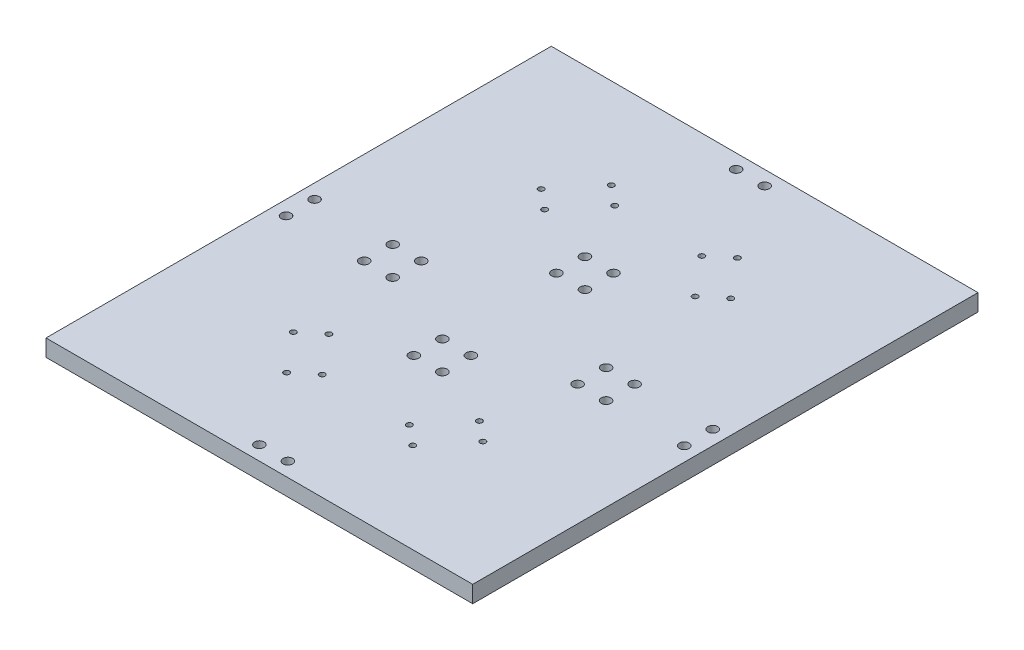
from build123d import *

# Parameters (mm, degrees)
F_12MM_THICK_DEPTH = 12
CUT_EXTRUDE1_REACH = 237.911
LOCATION_SKETCH_R  = 2
CUT_EXTRUDE2_REACH = 237.911
SKETCH1_R          = 3.429
CUT_EXTRUDE3_REACH = 237.911
SKETCH2_R          = 3.429
CUT_EXTRUDE4_REACH = 237.911
SKETCH4_R          = 3.429
CUT_EXTRUDE5_REACH = 237.911
SKETCH5_R          = 3.429


with BuildPart() as part:
    # Thruster Placement Diagram → 12mm thick (new body)
    with BuildSketch(Plane(origin=(0, 0, 0), x_dir=(1, 0, 0), z_dir=(0, 1, 0))):
        Polygon((-112.019, -180), (112.019, -180), (152.019, -180), (152.019, -140), (152.019, 140), (152.019, 180), (112.019, 180), (-112.019, 180), (-152.019, 180), (-152.019, 140), (-152.019, -140), (-152.019, -180), align=None)
    extrude(amount=F_12MM_THICK_DEPTH)

    # Location Sketch → Cut-Extrude1 (cut, up to next)
    with BuildSketch(Plane(origin=(0, 12, 0), x_dir=(1, 0, 0), z_dir=(0, 1, 0)), mode=Mode.PRIVATE) as cut_extrude1_sk1:
        with Locations(Location((53.640426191, 76.82714233, 0), (0, 0, 270))):
            Circle(LOCATION_SKETCH_R)
    cut_extrude1_tool1 = extrude(cut_extrude1_sk1.sketch, amount=-CUT_EXTRUDE1_REACH, mode=Mode.PRIVATE) & part.part
    # Location Sketch → Cut-Extrude1 (cut, up to next)
    with BuildSketch(Plane(origin=(0, 12, 0), x_dir=(1, 0, 0), z_dir=(0, 1, 0)), mode=Mode.PRIVATE) as cut_extrude1_sk2:
        with Locations(Location((67.519782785, 88.288532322, 0), (0, 0, 270))):
            Circle(LOCATION_SKETCH_R)
    cut_extrude1_tool2 = extrude(cut_extrude1_sk2.sketch, amount=-CUT_EXTRUDE1_REACH, mode=Mode.PRIVATE) & part.part
    # Location Sketch → Cut-Extrude1 (cut, up to next)
    with BuildSketch(Plane(origin=(0, 12, 0), x_dir=(1, 0, 0), z_dir=(0, 1, 0)), mode=Mode.PRIVATE) as cut_extrude1_sk3:
        with Locations(Location((44.915377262, 115.661709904, 0), (0, 0, 270))):
            Circle(LOCATION_SKETCH_R)
    cut_extrude1_tool3 = extrude(cut_extrude1_sk3.sketch, amount=-CUT_EXTRUDE1_REACH, mode=Mode.PRIVATE) & part.part
    # Location Sketch → Cut-Extrude1 (cut, up to next)
    with BuildSketch(Plane(origin=(0, 12, 0), x_dir=(1, 0, 0), z_dir=(0, 1, 0)), mode=Mode.PRIVATE) as cut_extrude1_sk4:
        with Locations(Location((31.036020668, 104.200319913, 0), (0, 0, 270))):
            Circle(LOCATION_SKETCH_R)
    cut_extrude1_tool4 = extrude(cut_extrude1_sk4.sketch, amount=-CUT_EXTRUDE1_REACH, mode=Mode.PRIVATE) & part.part
    # Location Sketch → Cut-Extrude1 (cut, up to next)
    with BuildSketch(Plane(origin=(0, 12, 0), x_dir=(1, 0, 0), z_dir=(0, 1, 0)), mode=Mode.PRIVATE) as cut_extrude1_sk5:
        with Locations(Location((-67.519782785, 88.288532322, 0), (0, 0, 270))):
            Circle(LOCATION_SKETCH_R)
    cut_extrude1_tool5 = extrude(cut_extrude1_sk5.sketch, amount=-CUT_EXTRUDE1_REACH, mode=Mode.PRIVATE) & part.part
    # Location Sketch → Cut-Extrude1 (cut, up to next)
    with BuildSketch(Plane(origin=(0, 12, 0), x_dir=(1, 0, 0), z_dir=(0, 1, 0)), mode=Mode.PRIVATE) as cut_extrude1_sk6:
        with Locations(Location((-53.640426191, 76.82714233, 0), (0, 0, 270))):
            Circle(LOCATION_SKETCH_R)
    cut_extrude1_tool6 = extrude(cut_extrude1_sk6.sketch, amount=-CUT_EXTRUDE1_REACH, mode=Mode.PRIVATE) & part.part
    # Location Sketch → Cut-Extrude1 (cut, up to next)
    with BuildSketch(Plane(origin=(0, 12, 0), x_dir=(1, 0, 0), z_dir=(0, 1, 0)), mode=Mode.PRIVATE) as cut_extrude1_sk7:
        with Locations(Location((-44.915377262, 115.661709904, 0), (0, 0, 270))):
            Circle(LOCATION_SKETCH_R)
    cut_extrude1_tool7 = extrude(cut_extrude1_sk7.sketch, amount=-CUT_EXTRUDE1_REACH, mode=Mode.PRIVATE) & part.part
    # Location Sketch → Cut-Extrude1 (cut, up to next)
    with BuildSketch(Plane(origin=(0, 12, 0), x_dir=(1, 0, 0), z_dir=(0, 1, 0)), mode=Mode.PRIVATE) as cut_extrude1_sk8:
        with Locations(Location((-31.036020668, 104.200319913, 0), (0, 0, 270))):
            Circle(LOCATION_SKETCH_R)
    cut_extrude1_tool8 = extrude(cut_extrude1_sk8.sketch, amount=-CUT_EXTRUDE1_REACH, mode=Mode.PRIVATE) & part.part
    # Location Sketch → Cut-Extrude1 (cut, up to next)
    with BuildSketch(Plane(origin=(0, 12, 0), x_dir=(1, 0, 0), z_dir=(0, 1, 0)), mode=Mode.PRIVATE) as cut_extrude1_sk9:
        with Locations(Location((67.519782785, -88.288532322, 0), (0, 0, 270))):
            Circle(LOCATION_SKETCH_R)
    cut_extrude1_tool9 = extrude(cut_extrude1_sk9.sketch, amount=-CUT_EXTRUDE1_REACH, mode=Mode.PRIVATE) & part.part
    # Location Sketch → Cut-Extrude1 (cut, up to next)
    with BuildSketch(Plane(origin=(0, 12, 0), x_dir=(1, 0, 0), z_dir=(0, 1, 0)), mode=Mode.PRIVATE) as cut_extrude1_sk10:
        with Locations(Location((53.640426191, -76.82714233, 0), (0, 0, 270))):
            Circle(LOCATION_SKETCH_R)
    cut_extrude1_tool10 = extrude(cut_extrude1_sk10.sketch, amount=-CUT_EXTRUDE1_REACH, mode=Mode.PRIVATE) & part.part
    # Location Sketch → Cut-Extrude1 (cut, up to next)
    with BuildSketch(Plane(origin=(0, 12, 0), x_dir=(1, 0, 0), z_dir=(0, 1, 0)), mode=Mode.PRIVATE) as cut_extrude1_sk11:
        with Locations(Location((44.915377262, -115.661709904, 0), (0, 0, 270))):
            Circle(LOCATION_SKETCH_R)
    cut_extrude1_tool11 = extrude(cut_extrude1_sk11.sketch, amount=-CUT_EXTRUDE1_REACH, mode=Mode.PRIVATE) & part.part
    # Location Sketch → Cut-Extrude1 (cut, up to next)
    with BuildSketch(Plane(origin=(0, 12, 0), x_dir=(1, 0, 0), z_dir=(0, 1, 0)), mode=Mode.PRIVATE) as cut_extrude1_sk12:
        with Locations(Location((31.036020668, -104.200319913, 0), (0, 0, 270))):
            Circle(LOCATION_SKETCH_R)
    cut_extrude1_tool12 = extrude(cut_extrude1_sk12.sketch, amount=-CUT_EXTRUDE1_REACH, mode=Mode.PRIVATE) & part.part
    # Location Sketch → Cut-Extrude1 (cut, up to next)
    with BuildSketch(Plane(origin=(0, 12, 0), x_dir=(1, 0, 0), z_dir=(0, 1, 0)), mode=Mode.PRIVATE) as cut_extrude1_sk13:
        with Locations(Location((-31.036020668, -104.200319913, 0), (0, 0, 270))):
            Circle(LOCATION_SKETCH_R)
    cut_extrude1_tool13 = extrude(cut_extrude1_sk13.sketch, amount=-CUT_EXTRUDE1_REACH, mode=Mode.PRIVATE) & part.part
    # Location Sketch → Cut-Extrude1 (cut, up to next)
    with BuildSketch(Plane(origin=(0, 12, 0), x_dir=(1, 0, 0), z_dir=(0, 1, 0)), mode=Mode.PRIVATE) as cut_extrude1_sk14:
        with Locations(Location((-44.915377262, -115.661709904, 0), (0, 0, 270))):
            Circle(LOCATION_SKETCH_R)
    cut_extrude1_tool14 = extrude(cut_extrude1_sk14.sketch, amount=-CUT_EXTRUDE1_REACH, mode=Mode.PRIVATE) & part.part
    # Location Sketch → Cut-Extrude1 (cut, up to next)
    with BuildSketch(Plane(origin=(0, 12, 0), x_dir=(1, 0, 0), z_dir=(0, 1, 0)), mode=Mode.PRIVATE) as cut_extrude1_sk15:
        with Locations(Location((-53.640426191, -76.82714233, 0), (0, 0, 270))):
            Circle(LOCATION_SKETCH_R)
    cut_extrude1_tool15 = extrude(cut_extrude1_sk15.sketch, amount=-CUT_EXTRUDE1_REACH, mode=Mode.PRIVATE) & part.part
    # Location Sketch → Cut-Extrude1 (cut, up to next)
    with BuildSketch(Plane(origin=(0, 12, 0), x_dir=(1, 0, 0), z_dir=(0, 1, 0)), mode=Mode.PRIVATE) as cut_extrude1_sk16:
        with Locations(Location((-67.519782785, -88.288532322, 0), (0, 0, 270))):
            Circle(LOCATION_SKETCH_R)
    cut_extrude1_tool16 = extrude(cut_extrude1_sk16.sketch, amount=-CUT_EXTRUDE1_REACH, mode=Mode.PRIVATE) & part.part
    add(cut_extrude1_tool1.solids().sort_by_distance((53.640426, 12, -76.827142))[0], mode=Mode.SUBTRACT)
    add(cut_extrude1_tool2.solids().sort_by_distance((67.519783, 12, -88.288532))[0], mode=Mode.SUBTRACT)
    add(cut_extrude1_tool3.solids().sort_by_distance((44.915377, 12, -115.66171))[0], mode=Mode.SUBTRACT)
    add(cut_extrude1_tool4.solids().sort_by_distance((31.036021, 12, -104.20032))[0], mode=Mode.SUBTRACT)
    add(cut_extrude1_tool5.solids().sort_by_distance((-67.519783, 12, -88.288532))[0], mode=Mode.SUBTRACT)
    add(cut_extrude1_tool6.solids().sort_by_distance((-53.640426, 12, -76.827142))[0], mode=Mode.SUBTRACT)
    add(cut_extrude1_tool7.solids().sort_by_distance((-44.915377, 12, -115.66171))[0], mode=Mode.SUBTRACT)
    add(cut_extrude1_tool8.solids().sort_by_distance((-31.036021, 12, -104.20032))[0], mode=Mode.SUBTRACT)
    add(cut_extrude1_tool9.solids().sort_by_distance((67.519783, 12, 88.288532))[0], mode=Mode.SUBTRACT)
    add(cut_extrude1_tool10.solids().sort_by_distance((53.640426, 12, 76.827142))[0], mode=Mode.SUBTRACT)
    add(cut_extrude1_tool11.solids().sort_by_distance((44.915377, 12, 115.66171))[0], mode=Mode.SUBTRACT)
    add(cut_extrude1_tool12.solids().sort_by_distance((31.036021, 12, 104.20032))[0], mode=Mode.SUBTRACT)
    add(cut_extrude1_tool13.solids().sort_by_distance((-31.036021, 12, 104.20032))[0], mode=Mode.SUBTRACT)
    add(cut_extrude1_tool14.solids().sort_by_distance((-44.915377, 12, 115.66171))[0], mode=Mode.SUBTRACT)
    add(cut_extrude1_tool15.solids().sort_by_distance((-53.640426, 12, 76.827142))[0], mode=Mode.SUBTRACT)
    add(cut_extrude1_tool16.solids().sort_by_distance((-67.519783, 12, 88.288532))[0], mode=Mode.SUBTRACT)

    # Sketch1 → Cut-Extrude2 (cut, up to next)
    with BuildSketch(Plane(origin=(0, 12, 0), x_dir=(1, 0, 0), z_dir=(0, 1, 0)), mode=Mode.PRIVATE) as cut_extrude2_sk1:
        with Locations(Location((-86.1695, 1.184, 0), (0, 0, 270))):
            Circle(SKETCH1_R)
    cut_extrude2_tool1 = extrude(cut_extrude2_sk1.sketch, amount=-CUT_EXTRUDE2_REACH, mode=Mode.PRIVATE) & part.part
    # Sketch1 → Cut-Extrude2 (cut, up to next)
    with BuildSketch(Plane(origin=(0, 12, 0), x_dir=(1, 0, 0), z_dir=(0, 1, 0)), mode=Mode.PRIVATE) as cut_extrude2_sk2:
        with Locations(Location((-65.8495, 1.184, 0), (0, 0, 270))):
            Circle(SKETCH1_R)
    cut_extrude2_tool2 = extrude(cut_extrude2_sk2.sketch, amount=-CUT_EXTRUDE2_REACH, mode=Mode.PRIVATE) & part.part
    # Sketch1 → Cut-Extrude2 (cut, up to next)
    with BuildSketch(Plane(origin=(0, 12, 0), x_dir=(1, 0, 0), z_dir=(0, 1, 0)), mode=Mode.PRIVATE) as cut_extrude2_sk3:
        with Locations(Location((-86.1695, -19.136, 0), (0, 0, 270))):
            Circle(SKETCH1_R)
    cut_extrude2_tool3 = extrude(cut_extrude2_sk3.sketch, amount=-CUT_EXTRUDE2_REACH, mode=Mode.PRIVATE) & part.part
    # Sketch1 → Cut-Extrude2 (cut, up to next)
    with BuildSketch(Plane(origin=(0, 12, 0), x_dir=(1, 0, 0), z_dir=(0, 1, 0)), mode=Mode.PRIVATE) as cut_extrude2_sk4:
        with Locations(Location((-65.8495, -19.136, 0), (0, 0, 270))):
            Circle(SKETCH1_R)
    cut_extrude2_tool4 = extrude(cut_extrude2_sk4.sketch, amount=-CUT_EXTRUDE2_REACH, mode=Mode.PRIVATE) & part.part
    # Sketch1 → Cut-Extrude2 (cut, up to next)
    with BuildSketch(Plane(origin=(0, 12, 0), x_dir=(1, 0, 0), z_dir=(0, 1, 0)), mode=Mode.PRIVATE) as cut_extrude2_sk5:
        with Locations(Location((65.8495, 1.184, 0), (0, 0, 270))):
            Circle(SKETCH1_R)
    cut_extrude2_tool5 = extrude(cut_extrude2_sk5.sketch, amount=-CUT_EXTRUDE2_REACH, mode=Mode.PRIVATE) & part.part
    # Sketch1 → Cut-Extrude2 (cut, up to next)
    with BuildSketch(Plane(origin=(0, 12, 0), x_dir=(1, 0, 0), z_dir=(0, 1, 0)), mode=Mode.PRIVATE) as cut_extrude2_sk6:
        with Locations(Location((65.8495, -19.136, 0), (0, 0, 270))):
            Circle(SKETCH1_R)
    cut_extrude2_tool6 = extrude(cut_extrude2_sk6.sketch, amount=-CUT_EXTRUDE2_REACH, mode=Mode.PRIVATE) & part.part
    # Sketch1 → Cut-Extrude2 (cut, up to next)
    with BuildSketch(Plane(origin=(0, 12, 0), x_dir=(1, 0, 0), z_dir=(0, 1, 0)), mode=Mode.PRIVATE) as cut_extrude2_sk7:
        with Locations(Location((86.1695, -19.136, 0), (0, 0, 270))):
            Circle(SKETCH1_R)
    cut_extrude2_tool7 = extrude(cut_extrude2_sk7.sketch, amount=-CUT_EXTRUDE2_REACH, mode=Mode.PRIVATE) & part.part
    # Sketch1 → Cut-Extrude2 (cut, up to next)
    with BuildSketch(Plane(origin=(0, 12, 0), x_dir=(1, 0, 0), z_dir=(0, 1, 0)), mode=Mode.PRIVATE) as cut_extrude2_sk8:
        with Locations(Location((86.1695, 1.184, 0), (0, 0, 270))):
            Circle(SKETCH1_R)
    cut_extrude2_tool8 = extrude(cut_extrude2_sk8.sketch, amount=-CUT_EXTRUDE2_REACH, mode=Mode.PRIVATE) & part.part
    add(cut_extrude2_tool1.solids().sort_by_distance((-86.1695, 12, -1.184))[0], mode=Mode.SUBTRACT)
    add(cut_extrude2_tool2.solids().sort_by_distance((-65.8495, 12, -1.184))[0], mode=Mode.SUBTRACT)
    add(cut_extrude2_tool3.solids().sort_by_distance((-86.1695, 12, 19.136))[0], mode=Mode.SUBTRACT)
    add(cut_extrude2_tool4.solids().sort_by_distance((-65.8495, 12, 19.136))[0], mode=Mode.SUBTRACT)
    add(cut_extrude2_tool5.solids().sort_by_distance((65.8495, 12, -1.184))[0], mode=Mode.SUBTRACT)
    add(cut_extrude2_tool6.solids().sort_by_distance((65.8495, 12, 19.136))[0], mode=Mode.SUBTRACT)
    add(cut_extrude2_tool7.solids().sort_by_distance((86.1695, 12, 19.136))[0], mode=Mode.SUBTRACT)
    add(cut_extrude2_tool8.solids().sort_by_distance((86.1695, 12, -1.184))[0], mode=Mode.SUBTRACT)

    # Sketch2 → Cut-Extrude3 (cut, up to next)
    with BuildSketch(Plane(origin=(0, 12, 0), x_dir=(1, 0, 0), z_dir=(0, 1, 0)), mode=Mode.PRIVATE) as cut_extrude3_sk1:
        with Locations(Location((-141.859, 1.184, 0), (0, 0, 270))):
            Circle(SKETCH2_R)
    cut_extrude3_tool1 = extrude(cut_extrude3_sk1.sketch, amount=-CUT_EXTRUDE3_REACH, mode=Mode.PRIVATE) & part.part
    # Sketch2 → Cut-Extrude3 (cut, up to next)
    with BuildSketch(Plane(origin=(0, 12, 0), x_dir=(1, 0, 0), z_dir=(0, 1, 0)), mode=Mode.PRIVATE) as cut_extrude3_sk2:
        with Locations(Location((-141.859, -19.136, 0), (0, 0, 270))):
            Circle(SKETCH2_R)
    cut_extrude3_tool2 = extrude(cut_extrude3_sk2.sketch, amount=-CUT_EXTRUDE3_REACH, mode=Mode.PRIVATE) & part.part
    # Sketch2 → Cut-Extrude3 (cut, up to next)
    with BuildSketch(Plane(origin=(0, 12, 0), x_dir=(1, 0, 0), z_dir=(0, 1, 0)), mode=Mode.PRIVATE) as cut_extrude3_sk3:
        with Locations(Location((141.859, -19.136, 0), (0, 0, 270))):
            Circle(SKETCH2_R)
    cut_extrude3_tool3 = extrude(cut_extrude3_sk3.sketch, amount=-CUT_EXTRUDE3_REACH, mode=Mode.PRIVATE) & part.part
    # Sketch2 → Cut-Extrude3 (cut, up to next)
    with BuildSketch(Plane(origin=(0, 12, 0), x_dir=(1, 0, 0), z_dir=(0, 1, 0)), mode=Mode.PRIVATE) as cut_extrude3_sk4:
        with Locations(Location((141.859, 1.184, 0), (0, 0, 270))):
            Circle(SKETCH2_R)
    cut_extrude3_tool4 = extrude(cut_extrude3_sk4.sketch, amount=-CUT_EXTRUDE3_REACH, mode=Mode.PRIVATE) & part.part
    add(cut_extrude3_tool1.solids().sort_by_distance((-141.859, 12, -1.184))[0], mode=Mode.SUBTRACT)
    add(cut_extrude3_tool2.solids().sort_by_distance((-141.859, 12, 19.136))[0], mode=Mode.SUBTRACT)
    add(cut_extrude3_tool3.solids().sort_by_distance((141.859, 12, 19.136))[0], mode=Mode.SUBTRACT)
    add(cut_extrude3_tool4.solids().sort_by_distance((141.859, 12, -1.184))[0], mode=Mode.SUBTRACT)

    # Sketch4 → Cut-Extrude4 (cut, up to next)
    with BuildSketch(Plane(origin=(0, 12, 0), x_dir=(1, 0, 0), z_dir=(0, 1, 0)), mode=Mode.PRIVATE) as cut_extrude4_sk1:
        with Locations(Location((-10.16, 169.84, 0), (0, 0, 270))):
            Circle(SKETCH4_R)
    cut_extrude4_tool1 = extrude(cut_extrude4_sk1.sketch, amount=-CUT_EXTRUDE4_REACH, mode=Mode.PRIVATE) & part.part
    # Sketch4 → Cut-Extrude4 (cut, up to next)
    with BuildSketch(Plane(origin=(0, 12, 0), x_dir=(1, 0, 0), z_dir=(0, 1, 0)), mode=Mode.PRIVATE) as cut_extrude4_sk2:
        with Locations(Location((10.16, 169.84, 0), (0, 0, 270))):
            Circle(SKETCH4_R)
    cut_extrude4_tool2 = extrude(cut_extrude4_sk2.sketch, amount=-CUT_EXTRUDE4_REACH, mode=Mode.PRIVATE) & part.part
    # Sketch4 → Cut-Extrude4 (cut, up to next)
    with BuildSketch(Plane(origin=(0, 12, 0), x_dir=(1, 0, 0), z_dir=(0, 1, 0)), mode=Mode.PRIVATE) as cut_extrude4_sk3:
        with Locations(Location((10.16, -169.84, 0), (0, 0, 270))):
            Circle(SKETCH4_R)
    cut_extrude4_tool3 = extrude(cut_extrude4_sk3.sketch, amount=-CUT_EXTRUDE4_REACH, mode=Mode.PRIVATE) & part.part
    # Sketch4 → Cut-Extrude4 (cut, up to next)
    with BuildSketch(Plane(origin=(0, 12, 0), x_dir=(1, 0, 0), z_dir=(0, 1, 0)), mode=Mode.PRIVATE) as cut_extrude4_sk4:
        with Locations(Location((-10.16, -169.84, 0), (0, 0, 270))):
            Circle(SKETCH4_R)
    cut_extrude4_tool4 = extrude(cut_extrude4_sk4.sketch, amount=-CUT_EXTRUDE4_REACH, mode=Mode.PRIVATE) & part.part
    add(cut_extrude4_tool1.solids().sort_by_distance((-10.16, 12, -169.84))[0], mode=Mode.SUBTRACT)
    add(cut_extrude4_tool2.solids().sort_by_distance((10.16, 12, -169.84))[0], mode=Mode.SUBTRACT)
    add(cut_extrude4_tool3.solids().sort_by_distance((10.16, 12, 169.84))[0], mode=Mode.SUBTRACT)
    add(cut_extrude4_tool4.solids().sort_by_distance((-10.16, 12, 169.84))[0], mode=Mode.SUBTRACT)

    # Sketch5 → Cut-Extrude5 (cut, up to next)
    with BuildSketch(Plane(origin=(0, 12, 0), x_dir=(1, 0, 0), z_dir=(0, 1, 0)), mode=Mode.PRIVATE) as cut_extrude5_sk1:
        with Locations(Location((-10.16, 62.144, 0), (0, 0, 270))):
            Circle(SKETCH5_R)
    cut_extrude5_tool1 = extrude(cut_extrude5_sk1.sketch, amount=-CUT_EXTRUDE5_REACH, mode=Mode.PRIVATE) & part.part
    # Sketch5 → Cut-Extrude5 (cut, up to next)
    with BuildSketch(Plane(origin=(0, 12, 0), x_dir=(1, 0, 0), z_dir=(0, 1, 0)), mode=Mode.PRIVATE) as cut_extrude5_sk2:
        with Locations(Location((10.16, 62.144, 0), (0, 0, 270))):
            Circle(SKETCH5_R)
    cut_extrude5_tool2 = extrude(cut_extrude5_sk2.sketch, amount=-CUT_EXTRUDE5_REACH, mode=Mode.PRIVATE) & part.part
    # Sketch5 → Cut-Extrude5 (cut, up to next)
    with BuildSketch(Plane(origin=(0, 12, 0), x_dir=(1, 0, 0), z_dir=(0, 1, 0)), mode=Mode.PRIVATE) as cut_extrude5_sk3:
        with Locations(Location((10.16, 41.824, 0), (0, 0, 270))):
            Circle(SKETCH5_R)
    cut_extrude5_tool3 = extrude(cut_extrude5_sk3.sketch, amount=-CUT_EXTRUDE5_REACH, mode=Mode.PRIVATE) & part.part
    # Sketch5 → Cut-Extrude5 (cut, up to next)
    with BuildSketch(Plane(origin=(0, 12, 0), x_dir=(1, 0, 0), z_dir=(0, 1, 0)), mode=Mode.PRIVATE) as cut_extrude5_sk4:
        with Locations(Location((-10.16, 41.824, 0), (0, 0, 270))):
            Circle(SKETCH5_R)
    cut_extrude5_tool4 = extrude(cut_extrude5_sk4.sketch, amount=-CUT_EXTRUDE5_REACH, mode=Mode.PRIVATE) & part.part
    # Sketch5 → Cut-Extrude5 (cut, up to next)
    with BuildSketch(Plane(origin=(0, 12, 0), x_dir=(1, 0, 0), z_dir=(0, 1, 0)), mode=Mode.PRIVATE) as cut_extrude5_sk5:
        with Locations(Location((10.16, -39.456, 0), (0, 0, 270))):
            Circle(SKETCH5_R)
    cut_extrude5_tool5 = extrude(cut_extrude5_sk5.sketch, amount=-CUT_EXTRUDE5_REACH, mode=Mode.PRIVATE) & part.part
    # Sketch5 → Cut-Extrude5 (cut, up to next)
    with BuildSketch(Plane(origin=(0, 12, 0), x_dir=(1, 0, 0), z_dir=(0, 1, 0)), mode=Mode.PRIVATE) as cut_extrude5_sk6:
        with Locations(Location((-10.16, -39.456, 0), (0, 0, 270))):
            Circle(SKETCH5_R)
    cut_extrude5_tool6 = extrude(cut_extrude5_sk6.sketch, amount=-CUT_EXTRUDE5_REACH, mode=Mode.PRIVATE) & part.part
    # Sketch5 → Cut-Extrude5 (cut, up to next)
    with BuildSketch(Plane(origin=(0, 12, 0), x_dir=(1, 0, 0), z_dir=(0, 1, 0)), mode=Mode.PRIVATE) as cut_extrude5_sk7:
        with Locations(Location((10.16, -59.776, 0), (0, 0, 270))):
            Circle(SKETCH5_R)
    cut_extrude5_tool7 = extrude(cut_extrude5_sk7.sketch, amount=-CUT_EXTRUDE5_REACH, mode=Mode.PRIVATE) & part.part
    # Sketch5 → Cut-Extrude5 (cut, up to next)
    with BuildSketch(Plane(origin=(0, 12, 0), x_dir=(1, 0, 0), z_dir=(0, 1, 0)), mode=Mode.PRIVATE) as cut_extrude5_sk8:
        with Locations(Location((-10.16, -59.776, 0), (0, 0, 270))):
            Circle(SKETCH5_R)
    cut_extrude5_tool8 = extrude(cut_extrude5_sk8.sketch, amount=-CUT_EXTRUDE5_REACH, mode=Mode.PRIVATE) & part.part
    add(cut_extrude5_tool1.solids().sort_by_distance((-10.16, 12, -62.144))[0], mode=Mode.SUBTRACT)
    add(cut_extrude5_tool2.solids().sort_by_distance((10.16, 12, -62.144))[0], mode=Mode.SUBTRACT)
    add(cut_extrude5_tool3.solids().sort_by_distance((10.16, 12, -41.824))[0], mode=Mode.SUBTRACT)
    add(cut_extrude5_tool4.solids().sort_by_distance((-10.16, 12, -41.824))[0], mode=Mode.SUBTRACT)
    add(cut_extrude5_tool5.solids().sort_by_distance((10.16, 12, 39.456))[0], mode=Mode.SUBTRACT)
    add(cut_extrude5_tool6.solids().sort_by_distance((-10.16, 12, 39.456))[0], mode=Mode.SUBTRACT)
    add(cut_extrude5_tool7.solids().sort_by_distance((10.16, 12, 59.776))[0], mode=Mode.SUBTRACT)
    add(cut_extrude5_tool8.solids().sort_by_distance((-10.16, 12, 59.776))[0], mode=Mode.SUBTRACT)


solid = part.part
